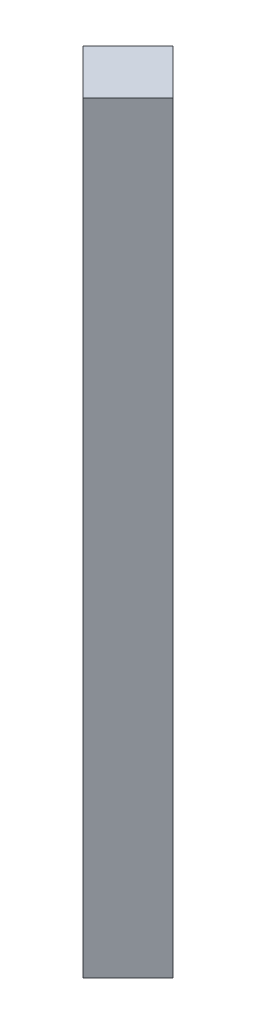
ISO-10303-21;
HEADER;
FILE_DESCRIPTION(('STEP AP214'),'2;1');
FILE_NAME('part.step','',(''),(''),'','','');
FILE_SCHEMA(('AUTOMOTIVE_DESIGN { 1 0 10303 214 1 1 1 1 }'));
ENDSEC;
DATA;
#1=APPLICATION_CONTEXT('core data for automotive mechanical design processes');
#2=APPLICATION_PROTOCOL_DEFINITION('international standard','automotive_design',2000,#1);
#3=PRODUCT_CONTEXT('',#1,'mechanical');
#4=PRODUCT('Part','Part','',(#3));
#5=PRODUCT_RELATED_PRODUCT_CATEGORY('part','',(#4));
#6=PRODUCT_DEFINITION_FORMATION('','',#4);
#7=PRODUCT_DEFINITION_CONTEXT('part definition',#1,'design');
#8=PRODUCT_DEFINITION('design','',#6,#7);
#9=PRODUCT_DEFINITION_SHAPE('','',#8);
#10=(LENGTH_UNIT() NAMED_UNIT(*) SI_UNIT(.MILLI.,.METRE.));
#11=(NAMED_UNIT(*) PLANE_ANGLE_UNIT() SI_UNIT($,.RADIAN.));
#12=(NAMED_UNIT(*) SI_UNIT($,.STERADIAN.) SOLID_ANGLE_UNIT());
#13=UNCERTAINTY_MEASURE_WITH_UNIT(LENGTH_MEASURE(1.E-05),#10,'distance_accuracy_value','');
#14=(GEOMETRIC_REPRESENTATION_CONTEXT(3) GLOBAL_UNCERTAINTY_ASSIGNED_CONTEXT((#13)) GLOBAL_UNIT_ASSIGNED_CONTEXT((#10,
#11,#12)) REPRESENTATION_CONTEXT('',''));
#15=CARTESIAN_POINT('',(0.,0.,0.));
#16=DIRECTION('',(0.,0.,1.));
#17=DIRECTION('',(1.,0.,0.));
#18=AXIS2_PLACEMENT_3D('',#15,#16,#17);
#19=CARTESIAN_POINT('',(12.7,304.8,5.26051224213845));
#20=DIRECTION('',(0.707106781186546,0.,-0.707106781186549));
#21=DIRECTION('',(-0.707106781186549,0.,-0.707106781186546));
#22=AXIS2_PLACEMENT_3D('',#19,#20,#21);
#23=PLANE('',#22);
#24=DIRECTION('',(0.707106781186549,0.,0.707106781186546));
#25=VECTOR('',#24,1.);
#26=CARTESIAN_POINT('',(12.7,0.,5.26051224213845));
#27=LINE('',#26,#25);
#28=CARTESIAN_POINT('',(-5.26051224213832,0.,-12.6999999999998));
#29=VERTEX_POINT('',#28);
#30=CARTESIAN_POINT('',(12.7,0.,5.26051224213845));
#31=VERTEX_POINT('',#30);
#32=EDGE_CURVE('E104',#29,#31,#27,.T.);
#33=ORIENTED_EDGE('',*,*,#32,.T.);
#34=DIRECTION('',(0.,-1.,0.));
#35=VECTOR('',#34,1.);
#36=CARTESIAN_POINT('',(12.7,304.8,5.26051224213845));
#37=LINE('',#36,#35);
#38=CARTESIAN_POINT('',(12.7,304.8,5.26051224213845));
#39=VERTEX_POINT('',#38);
#40=EDGE_CURVE('E11',#39,#31,#37,.T.);
#41=ORIENTED_EDGE('',*,*,#40,.F.);
#42=DIRECTION('',(0.707106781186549,0.,0.707106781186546));
#43=VECTOR('',#42,1.);
#44=CARTESIAN_POINT('',(12.7,304.8,5.26051224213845));
#45=LINE('',#44,#43);
#46=CARTESIAN_POINT('',(-5.26051224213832,304.8,-12.6999999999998));
#47=VERTEX_POINT('',#46);
#48=EDGE_CURVE('E92',#47,#39,#45,.T.);
#49=ORIENTED_EDGE('',*,*,#48,.F.);
#50=DIRECTION('',(0.,-1.,0.));
#51=VECTOR('',#50,1.);
#52=CARTESIAN_POINT('',(-5.26051224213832,304.8,-12.6999999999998));
#53=LINE('',#52,#51);
#54=EDGE_CURVE('E100',#47,#29,#53,.T.);
#55=ORIENTED_EDGE('',*,*,#54,.T.);
#56=EDGE_LOOP('',(#33,#41,#49,#55));
#57=FACE_BOUND('',#56,.T.);
#58=ADVANCED_FACE('F41',(#57),#23,.F.);
#59=CARTESIAN_POINT('',(12.7,304.8,5.26051224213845));
#60=DIRECTION('',(-0.707106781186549,0.,-0.707106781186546));
#61=DIRECTION('',(-0.707106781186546,0.,0.707106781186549));
#62=AXIS2_PLACEMENT_3D('',#59,#60,#61);
#63=PLANE('',#62);
#64=DIRECTION('',(0.707106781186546,0.,-0.707106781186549));
#65=VECTOR('',#64,1.);
#66=CARTESIAN_POINT('',(12.7,0.,5.26051224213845));
#67=LINE('',#66,#65);
#68=CARTESIAN_POINT('',(30.6605122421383,0.,-12.6999999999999));
#69=VERTEX_POINT('',#68);
#70=EDGE_CURVE('E96',#31,#69,#67,.T.);
#71=ORIENTED_EDGE('',*,*,#70,.T.);
#72=DIRECTION('',(0.,-1.,0.));
#73=VECTOR('',#72,1.);
#74=CARTESIAN_POINT('',(30.6605122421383,304.8,-12.6999999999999));
#75=LINE('',#74,#73);
#76=CARTESIAN_POINT('',(30.6605122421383,304.8,-12.6999999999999));
#77=VERTEX_POINT('',#76);
#78=EDGE_CURVE('E49',#77,#69,#75,.T.);
#79=ORIENTED_EDGE('',*,*,#78,.F.);
#80=DIRECTION('',(0.707106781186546,0.,-0.707106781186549));
#81=VECTOR('',#80,1.);
#82=CARTESIAN_POINT('',(12.7,304.8,5.26051224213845));
#83=LINE('',#82,#81);
#84=EDGE_CURVE('E87',#39,#77,#83,.T.);
#85=ORIENTED_EDGE('',*,*,#84,.F.);
#86=ORIENTED_EDGE('',*,*,#40,.T.);
#87=EDGE_LOOP('',(#71,#79,#85,#86));
#88=FACE_BOUND('',#87,.T.);
#89=ADVANCED_FACE('F95',(#88),#63,.F.);
#90=CARTESIAN_POINT('',(30.6605122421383,304.8,-12.6999999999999));
#91=DIRECTION('',(-0.707106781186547,0.,0.707106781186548));
#92=DIRECTION('',(0.707106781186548,0.,0.707106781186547));
#93=AXIS2_PLACEMENT_3D('',#90,#91,#92);
#94=PLANE('',#93);
#95=DIRECTION('',(-0.707106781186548,0.,-0.707106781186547));
#96=VECTOR('',#95,1.);
#97=CARTESIAN_POINT('',(30.6605122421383,0.,-12.6999999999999));
#98=LINE('',#97,#96);
#99=CARTESIAN_POINT('',(12.7,0.,-30.6605122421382));
#100=VERTEX_POINT('',#99);
#101=EDGE_CURVE('E74',#69,#100,#98,.T.);
#102=ORIENTED_EDGE('',*,*,#101,.T.);
#103=DIRECTION('',(0.,-1.,0.));
#104=VECTOR('',#103,1.);
#105=CARTESIAN_POINT('',(12.7,304.8,-30.6605122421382));
#106=LINE('',#105,#104);
#107=CARTESIAN_POINT('',(12.7,304.8,-30.6605122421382));
#108=VERTEX_POINT('',#107);
#109=EDGE_CURVE('E97',#108,#100,#106,.T.);
#110=ORIENTED_EDGE('',*,*,#109,.F.);
#111=DIRECTION('',(-0.707106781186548,0.,-0.707106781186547));
#112=VECTOR('',#111,1.);
#113=CARTESIAN_POINT('',(30.6605122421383,304.8,-12.6999999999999));
#114=LINE('',#113,#112);
#115=EDGE_CURVE('E90',#77,#108,#114,.T.);
#116=ORIENTED_EDGE('',*,*,#115,.F.);
#117=ORIENTED_EDGE('',*,*,#78,.T.);
#118=EDGE_LOOP('',(#102,#110,#116,#117));
#119=FACE_BOUND('',#118,.T.);
#120=ADVANCED_FACE('F98',(#119),#94,.F.);
#121=CARTESIAN_POINT('',(-5.26051224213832,304.8,-12.6999999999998));
#122=DIRECTION('',(0.707106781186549,0.,0.707106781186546));
#123=DIRECTION('',(0.707106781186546,0.,-0.707106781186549));
#124=AXIS2_PLACEMENT_3D('',#121,#122,#123);
#125=PLANE('',#124);
#126=DIRECTION('',(-0.707106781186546,0.,0.707106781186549));
#127=VECTOR('',#126,1.);
#128=CARTESIAN_POINT('',(-5.26051224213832,0.,-12.6999999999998));
#129=LINE('',#128,#127);
#130=EDGE_CURVE('E80',#100,#29,#129,.T.);
#131=ORIENTED_EDGE('',*,*,#130,.T.);
#132=ORIENTED_EDGE('',*,*,#54,.F.);
#133=DIRECTION('',(-0.707106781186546,0.,0.707106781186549));
#134=VECTOR('',#133,1.);
#135=CARTESIAN_POINT('',(-5.26051224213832,304.8,-12.6999999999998));
#136=LINE('',#135,#134);
#137=EDGE_CURVE('E57',#108,#47,#136,.T.);
#138=ORIENTED_EDGE('',*,*,#137,.F.);
#139=ORIENTED_EDGE('',*,*,#109,.T.);
#140=EDGE_LOOP('',(#131,#132,#138,#139));
#141=FACE_BOUND('',#140,.T.);
#142=ADVANCED_FACE('F111',(#141),#125,.F.);
#143=CARTESIAN_POINT('',(0.,304.8,0.));
#144=DIRECTION('',(0.,-1.,0.));
#145=DIRECTION('',(0.,0.,-1.));
#146=AXIS2_PLACEMENT_3D('',#143,#144,#145);
#147=PLANE('',#146);
#148=ORIENTED_EDGE('',*,*,#48,.T.);
#149=ORIENTED_EDGE('',*,*,#84,.T.);
#150=ORIENTED_EDGE('',*,*,#115,.T.);
#151=ORIENTED_EDGE('',*,*,#137,.T.);
#152=EDGE_LOOP('',(#148,#149,#150,#151));
#153=FACE_BOUND('',#152,.T.);
#154=ADVANCED_FACE('F88',(#153),#147,.F.);
#155=CARTESIAN_POINT('',(0.,0.,0.));
#156=DIRECTION('',(0.,-1.,0.));
#157=DIRECTION('',(0.,0.,-1.));
#158=AXIS2_PLACEMENT_3D('',#155,#156,#157);
#159=PLANE('',#158);
#160=ORIENTED_EDGE('',*,*,#32,.F.);
#161=ORIENTED_EDGE('',*,*,#130,.F.);
#162=ORIENTED_EDGE('',*,*,#101,.F.);
#163=ORIENTED_EDGE('',*,*,#70,.F.);
#164=EDGE_LOOP('',(#160,#161,#162,#163));
#165=FACE_BOUND('',#164,.T.);
#166=ADVANCED_FACE('F114',(#165),#159,.T.);
#167=CLOSED_SHELL('',(#58,#89,#120,#142,#154,#166));
#168=MANIFOLD_SOLID_BREP('B2',#167);
#169=ADVANCED_BREP_SHAPE_REPRESENTATION('',(#18,#168),#14);
#170=SHAPE_DEFINITION_REPRESENTATION(#9,#169);
ENDSEC;
END-ISO-10303-21;
